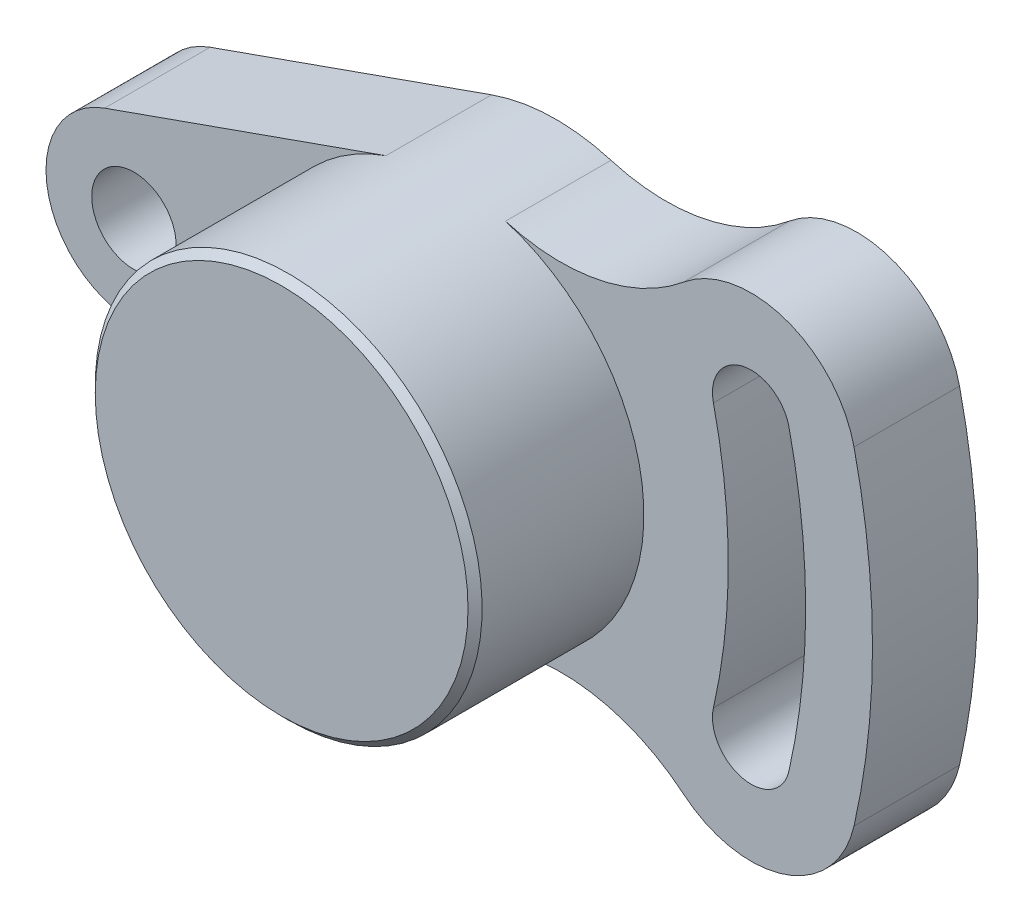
ISO-10303-21;
HEADER;
FILE_DESCRIPTION(('STEP AP214'),'2;1');
FILE_NAME('part.step','',(''),(''),'','','');
FILE_SCHEMA(('AUTOMOTIVE_DESIGN { 1 0 10303 214 1 1 1 1 }'));
ENDSEC;
DATA;
#1=APPLICATION_CONTEXT('core data for automotive mechanical design processes');
#2=APPLICATION_PROTOCOL_DEFINITION('international standard','automotive_design',2000,#1);
#3=PRODUCT_CONTEXT('',#1,'mechanical');
#4=PRODUCT('Part','Part','',(#3));
#5=PRODUCT_RELATED_PRODUCT_CATEGORY('part','',(#4));
#6=PRODUCT_DEFINITION_FORMATION('','',#4);
#7=PRODUCT_DEFINITION_CONTEXT('part definition',#1,'design');
#8=PRODUCT_DEFINITION('design','',#6,#7);
#9=PRODUCT_DEFINITION_SHAPE('','',#8);
#10=(LENGTH_UNIT() NAMED_UNIT(*) SI_UNIT(.MILLI.,.METRE.));
#11=(NAMED_UNIT(*) PLANE_ANGLE_UNIT() SI_UNIT($,.RADIAN.));
#12=(NAMED_UNIT(*) SI_UNIT($,.STERADIAN.) SOLID_ANGLE_UNIT());
#13=UNCERTAINTY_MEASURE_WITH_UNIT(LENGTH_MEASURE(1.E-05),#10,'distance_accuracy_value','');
#14=(GEOMETRIC_REPRESENTATION_CONTEXT(3) GLOBAL_UNCERTAINTY_ASSIGNED_CONTEXT((#13)) GLOBAL_UNIT_ASSIGNED_CONTEXT((#10,
#11,#12)) REPRESENTATION_CONTEXT('',''));
#15=CARTESIAN_POINT('',(0.,0.,0.));
#16=DIRECTION('',(0.,0.,1.));
#17=DIRECTION('',(1.,0.,0.));
#18=AXIS2_PLACEMENT_3D('',#15,#16,#17);
#19=CARTESIAN_POINT('',(87.7496438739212,-20.,15.));
#20=DIRECTION('',(0.,0.,1.));
#21=DIRECTION('',(0.,-1.,0.));
#22=AXIS2_PLACEMENT_3D('',#19,#20,#21);
#23=PLANE('',#22);
#24=CARTESIAN_POINT('',(45.,0.,15.));
#25=DIRECTION('',(0.,0.,1.));
#26=DIRECTION('',(0.,-1.,0.));
#27=AXIS2_PLACEMENT_3D('',#24,#25,#26);
#28=CIRCLE('',#27,27.5);
#29=CARTESIAN_POINT('',(52.8252184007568,-26.3631552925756,15.));
#30=VERTEX_POINT('',#29);
#31=CARTESIAN_POINT('',(52.8252184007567,26.3631552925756,15.));
#32=VERTEX_POINT('',#31);
#33=EDGE_CURVE('E130',#30,#32,#28,.T.);
#34=ORIENTED_EDGE('',*,*,#33,.F.);
#35=CARTESIAN_POINT('',(60.6438540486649,-52.7041332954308,15.));
#36=DIRECTION('',(0.,0.,1.));
#37=DIRECTION('',(0.,-1.,0.));
#38=AXIS2_PLACEMENT_3D('',#35,#36,#37);
#39=CIRCLE('',#38,27.4768663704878);
#40=CARTESIAN_POINT('',(78.1776843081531,-31.548921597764,15.));
#41=VERTEX_POINT('',#40);
#42=EDGE_CURVE('E114',#41,#30,#39,.T.);
#43=ORIENTED_EDGE('',*,*,#42,.F.);
#44=CARTESIAN_POINT('',(87.7496438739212,-20.,15.));
#45=DIRECTION('',(0.,0.,1.));
#46=DIRECTION('',(0.,-1.,0.));
#47=AXIS2_PLACEMENT_3D('',#44,#45,#46);
#48=CIRCLE('',#47,15.);
#49=CARTESIAN_POINT('',(102.374584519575,-23.3333333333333,15.));
#50=VERTEX_POINT('',#49);
#51=EDGE_CURVE('E287',#41,#50,#48,.T.);
#52=ORIENTED_EDGE('',*,*,#51,.T.);
#53=CARTESIAN_POINT('',(0.,0.,15.));
#54=DIRECTION('',(0.,0.,1.));
#55=DIRECTION('',(0.,-1.,0.));
#56=AXIS2_PLACEMENT_3D('',#53,#54,#55);
#57=CIRCLE('',#56,105.);
#58=CARTESIAN_POINT('',(102.374584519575,23.3333333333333,15.));
#59=VERTEX_POINT('',#58);
#60=EDGE_CURVE('E259',#50,#59,#57,.T.);
#61=ORIENTED_EDGE('',*,*,#60,.T.);
#62=CARTESIAN_POINT('',(87.7496438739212,20.,15.));
#63=DIRECTION('',(0.,0.,-1.));
#64=DIRECTION('',(0.,1.,0.));
#65=AXIS2_PLACEMENT_3D('',#62,#63,#64);
#66=CIRCLE('',#65,15.);
#67=CARTESIAN_POINT('',(78.1776843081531,31.548921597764,15.));
#68=VERTEX_POINT('',#67);
#69=EDGE_CURVE('E185',#68,#59,#66,.T.);
#70=ORIENTED_EDGE('',*,*,#69,.F.);
#71=CARTESIAN_POINT('',(60.6438540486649,52.7041332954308,15.));
#72=DIRECTION('',(0.,0.,-1.));
#73=DIRECTION('',(0.,1.,0.));
#74=AXIS2_PLACEMENT_3D('',#71,#72,#73);
#75=CIRCLE('',#74,27.4768663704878);
#76=EDGE_CURVE('E140',#68,#32,#75,.T.);
#77=ORIENTED_EDGE('',*,*,#76,.T.);
#78=EDGE_LOOP('',(#34,#43,#52,#61,#70,#77));
#79=FACE_BOUND('',#78,.T.);
#80=CARTESIAN_POINT('',(0.,0.,15.));
#81=DIRECTION('',(0.,0.,1.));
#82=DIRECTION('',(0.,-1.,0.));
#83=AXIS2_PLACEMENT_3D('',#80,#81,#82);
#84=CIRCLE('',#83,95.5);
#85=CARTESIAN_POINT('',(93.1121221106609,-21.2222222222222,15.));
#86=VERTEX_POINT('',#85);
#87=CARTESIAN_POINT('',(93.1121221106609,21.2222222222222,15.));
#88=VERTEX_POINT('',#87);
#89=EDGE_CURVE('E315',#86,#88,#84,.T.);
#90=ORIENTED_EDGE('',*,*,#89,.F.);
#91=CARTESIAN_POINT('',(87.7496438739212,-20.,15.));
#92=DIRECTION('',(0.,0.,1.));
#93=DIRECTION('',(0.,-1.,0.));
#94=AXIS2_PLACEMENT_3D('',#91,#92,#93);
#95=CIRCLE('',#94,5.5);
#96=CARTESIAN_POINT('',(82.3871656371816,-18.7777777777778,15.));
#97=VERTEX_POINT('',#96);
#98=EDGE_CURVE('E318',#97,#86,#95,.T.);
#99=ORIENTED_EDGE('',*,*,#98,.F.);
#100=CARTESIAN_POINT('',(0.,0.,15.));
#101=DIRECTION('',(0.,0.,1.));
#102=DIRECTION('',(0.,-1.,0.));
#103=AXIS2_PLACEMENT_3D('',#100,#101,#102);
#104=CIRCLE('',#103,84.5);
#105=CARTESIAN_POINT('',(82.3871656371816,18.7777777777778,15.));
#106=VERTEX_POINT('',#105);
#107=EDGE_CURVE('E311',#97,#106,#104,.T.);
#108=ORIENTED_EDGE('',*,*,#107,.T.);
#109=CARTESIAN_POINT('',(87.7496438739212,20.,15.));
#110=DIRECTION('',(0.,0.,-1.));
#111=DIRECTION('',(0.,1.,0.));
#112=AXIS2_PLACEMENT_3D('',#109,#110,#111);
#113=CIRCLE('',#112,5.5);
#114=EDGE_CURVE('E29',#106,#88,#113,.T.);
#115=ORIENTED_EDGE('',*,*,#114,.T.);
#116=EDGE_LOOP('',(#90,#99,#108,#115));
#117=FACE_BOUND('',#116,.T.);
#118=ADVANCED_FACE('F14',(#79,#117),#23,.T.);
#119=CARTESIAN_POINT('',(35.8333333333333,25.9272486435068,15.));
#120=VERTEX_POINT('',#119);
#121=CARTESIAN_POINT('',(35.8333333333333,-25.9272486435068,15.));
#122=VERTEX_POINT('',#121);
#123=EDGE_CURVE('E155',#120,#122,#28,.T.);
#124=ORIENTED_EDGE('',*,*,#123,.F.);
#125=DIRECTION('',(-0.942809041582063,-0.333333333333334,0.));
#126=VECTOR('',#125,1.);
#127=CARTESIAN_POINT('',(35.8333333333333,25.9272486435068,15.));
#128=LINE('',#127,#126);
#129=CARTESIAN_POINT('',(-4.1666666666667,11.7851130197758,15.));
#130=VERTEX_POINT('',#129);
#131=EDGE_CURVE('E175',#120,#130,#128,.T.);
#132=ORIENTED_EDGE('',*,*,#131,.T.);
#133=CARTESIAN_POINT('',(0.,0.,15.));
#134=DIRECTION('',(0.,0.,1.));
#135=DIRECTION('',(0.,-1.,0.));
#136=AXIS2_PLACEMENT_3D('',#133,#134,#135);
#137=CIRCLE('',#136,12.5);
#138=CARTESIAN_POINT('',(-4.1666666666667,-11.7851130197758,15.));
#139=VERTEX_POINT('',#138);
#140=EDGE_CURVE('E166',#130,#139,#137,.T.);
#141=ORIENTED_EDGE('',*,*,#140,.T.);
#142=DIRECTION('',(-0.942809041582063,0.333333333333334,0.));
#143=VECTOR('',#142,1.);
#144=CARTESIAN_POINT('',(35.8333333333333,-25.9272486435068,15.));
#145=LINE('',#144,#143);
#146=EDGE_CURVE('E125',#122,#139,#145,.T.);
#147=ORIENTED_EDGE('',*,*,#146,.F.);
#148=EDGE_LOOP('',(#124,#132,#141,#147));
#149=FACE_BOUND('',#148,.T.);
#150=CARTESIAN_POINT('',(0.,0.,15.));
#151=DIRECTION('',(0.,0.,1.));
#152=DIRECTION('',(0.,-1.,0.));
#153=AXIS2_PLACEMENT_3D('',#150,#151,#152);
#154=CIRCLE('',#153,6.);
#155=CARTESIAN_POINT('',(0.,-6.,15.));
#156=VERTEX_POINT('',#155);
#157=EDGE_CURVE('E144',#156,#156,#154,.T.);
#158=ORIENTED_EDGE('',*,*,#157,.F.);
#159=EDGE_LOOP('',(#158));
#160=FACE_BOUND('',#159,.T.);
#161=ADVANCED_FACE('F205',(#149,#160),#23,.T.);
#162=CARTESIAN_POINT('',(87.7496438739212,-20.,0.));
#163=DIRECTION('',(0.,0.,1.));
#164=DIRECTION('',(0.,-1.,0.));
#165=AXIS2_PLACEMENT_3D('',#162,#163,#164);
#166=PLANE('',#165);
#167=CARTESIAN_POINT('',(87.7496438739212,-20.,0.));
#168=DIRECTION('',(0.,0.,1.));
#169=DIRECTION('',(0.,-1.,0.));
#170=AXIS2_PLACEMENT_3D('',#167,#168,#169);
#171=CIRCLE('',#170,5.5);
#172=CARTESIAN_POINT('',(82.3871656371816,-18.7777777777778,0.));
#173=VERTEX_POINT('',#172);
#174=CARTESIAN_POINT('',(93.1121221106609,-21.2222222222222,0.));
#175=VERTEX_POINT('',#174);
#176=EDGE_CURVE('E37',#173,#175,#171,.T.);
#177=ORIENTED_EDGE('',*,*,#176,.T.);
#178=CARTESIAN_POINT('',(0.,0.,0.));
#179=DIRECTION('',(0.,0.,1.));
#180=DIRECTION('',(0.,-1.,0.));
#181=AXIS2_PLACEMENT_3D('',#178,#179,#180);
#182=CIRCLE('',#181,95.5);
#183=CARTESIAN_POINT('',(93.1121221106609,21.2222222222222,0.));
#184=VERTEX_POINT('',#183);
#185=EDGE_CURVE('E327',#175,#184,#182,.T.);
#186=ORIENTED_EDGE('',*,*,#185,.T.);
#187=CARTESIAN_POINT('',(87.7496438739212,20.,0.));
#188=DIRECTION('',(0.,0.,-1.));
#189=DIRECTION('',(0.,1.,0.));
#190=AXIS2_PLACEMENT_3D('',#187,#188,#189);
#191=CIRCLE('',#190,5.5);
#192=CARTESIAN_POINT('',(82.3871656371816,18.7777777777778,0.));
#193=VERTEX_POINT('',#192);
#194=EDGE_CURVE('E324',#193,#184,#191,.T.);
#195=ORIENTED_EDGE('',*,*,#194,.F.);
#196=CARTESIAN_POINT('',(0.,0.,0.));
#197=DIRECTION('',(0.,0.,1.));
#198=DIRECTION('',(0.,-1.,0.));
#199=AXIS2_PLACEMENT_3D('',#196,#197,#198);
#200=CIRCLE('',#199,84.5);
#201=EDGE_CURVE('E321',#173,#193,#200,.T.);
#202=ORIENTED_EDGE('',*,*,#201,.F.);
#203=EDGE_LOOP('',(#177,#186,#195,#202));
#204=FACE_BOUND('',#203,.T.);
#205=CARTESIAN_POINT('',(87.7496438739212,-20.,0.));
#206=DIRECTION('',(0.,0.,1.));
#207=DIRECTION('',(0.,-1.,0.));
#208=AXIS2_PLACEMENT_3D('',#205,#206,#207);
#209=CIRCLE('',#208,15.);
#210=CARTESIAN_POINT('',(78.1776843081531,-31.548921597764,0.));
#211=VERTEX_POINT('',#210);
#212=CARTESIAN_POINT('',(102.374584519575,-23.3333333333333,0.));
#213=VERTEX_POINT('',#212);
#214=EDGE_CURVE('E298',#211,#213,#209,.T.);
#215=ORIENTED_EDGE('',*,*,#214,.F.);
#216=CARTESIAN_POINT('',(60.6438540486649,-52.7041332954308,0.));
#217=DIRECTION('',(0.,0.,1.));
#218=DIRECTION('',(0.,-1.,0.));
#219=AXIS2_PLACEMENT_3D('',#216,#217,#218);
#220=CIRCLE('',#219,27.4768663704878);
#221=CARTESIAN_POINT('',(52.8252184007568,-26.3631552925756,0.));
#222=VERTEX_POINT('',#221);
#223=EDGE_CURVE('E285',#211,#222,#220,.T.);
#224=ORIENTED_EDGE('',*,*,#223,.T.);
#225=CARTESIAN_POINT('',(45.,0.,0.));
#226=DIRECTION('',(0.,0.,1.));
#227=DIRECTION('',(0.,-1.,0.));
#228=AXIS2_PLACEMENT_3D('',#225,#226,#227);
#229=CIRCLE('',#228,27.5);
#230=CARTESIAN_POINT('',(35.8333333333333,-25.9272486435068,0.));
#231=VERTEX_POINT('',#230);
#232=EDGE_CURVE('E132',#231,#222,#229,.T.);
#233=ORIENTED_EDGE('',*,*,#232,.F.);
#234=DIRECTION('',(-0.942809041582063,0.333333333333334,0.));
#235=VECTOR('',#234,1.);
#236=CARTESIAN_POINT('',(35.8333333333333,-25.9272486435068,0.));
#237=LINE('',#236,#235);
#238=CARTESIAN_POINT('',(-4.1666666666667,-11.7851130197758,0.));
#239=VERTEX_POINT('',#238);
#240=EDGE_CURVE('E279',#231,#239,#237,.T.);
#241=ORIENTED_EDGE('',*,*,#240,.T.);
#242=CARTESIAN_POINT('',(0.,0.,0.));
#243=DIRECTION('',(0.,0.,1.));
#244=DIRECTION('',(0.,-1.,0.));
#245=AXIS2_PLACEMENT_3D('',#242,#243,#244);
#246=CIRCLE('',#245,12.5);
#247=CARTESIAN_POINT('',(-4.1666666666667,11.7851130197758,0.));
#248=VERTEX_POINT('',#247);
#249=EDGE_CURVE('E277',#248,#239,#246,.T.);
#250=ORIENTED_EDGE('',*,*,#249,.F.);
#251=DIRECTION('',(-0.942809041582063,-0.333333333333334,0.));
#252=VECTOR('',#251,1.);
#253=CARTESIAN_POINT('',(35.8333333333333,25.9272486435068,0.));
#254=LINE('',#253,#252);
#255=CARTESIAN_POINT('',(35.8333333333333,25.9272486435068,0.));
#256=VERTEX_POINT('',#255);
#257=EDGE_CURVE('E269',#256,#248,#254,.T.);
#258=ORIENTED_EDGE('',*,*,#257,.F.);
#259=CARTESIAN_POINT('',(45.,0.,0.));
#260=DIRECTION('',(0.,0.,-1.));
#261=DIRECTION('',(0.,1.,0.));
#262=AXIS2_PLACEMENT_3D('',#259,#260,#261);
#263=CIRCLE('',#262,27.5);
#264=CARTESIAN_POINT('',(52.8252184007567,26.3631552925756,0.));
#265=VERTEX_POINT('',#264);
#266=EDGE_CURVE('E265',#256,#265,#263,.T.);
#267=ORIENTED_EDGE('',*,*,#266,.T.);
#268=CARTESIAN_POINT('',(60.6438540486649,52.7041332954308,0.));
#269=DIRECTION('',(0.,0.,-1.));
#270=DIRECTION('',(0.,1.,0.));
#271=AXIS2_PLACEMENT_3D('',#268,#269,#270);
#272=CIRCLE('',#271,27.4768663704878);
#273=CARTESIAN_POINT('',(78.1776843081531,31.548921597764,0.));
#274=VERTEX_POINT('',#273);
#275=EDGE_CURVE('E261',#274,#265,#272,.T.);
#276=ORIENTED_EDGE('',*,*,#275,.F.);
#277=CARTESIAN_POINT('',(87.7496438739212,20.,0.));
#278=DIRECTION('',(0.,0.,-1.));
#279=DIRECTION('',(0.,1.,0.));
#280=AXIS2_PLACEMENT_3D('',#277,#278,#279);
#281=CIRCLE('',#280,15.);
#282=CARTESIAN_POINT('',(102.374584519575,23.3333333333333,0.));
#283=VERTEX_POINT('',#282);
#284=EDGE_CURVE('E252',#274,#283,#281,.T.);
#285=ORIENTED_EDGE('',*,*,#284,.T.);
#286=CARTESIAN_POINT('',(0.,0.,0.));
#287=DIRECTION('',(0.,0.,1.));
#288=DIRECTION('',(0.,-1.,0.));
#289=AXIS2_PLACEMENT_3D('',#286,#287,#288);
#290=CIRCLE('',#289,105.);
#291=EDGE_CURVE('E297',#213,#283,#290,.T.);
#292=ORIENTED_EDGE('',*,*,#291,.F.);
#293=EDGE_LOOP('',(#215,#224,#233,#241,#250,#258,#267,#276,#285,#292));
#294=FACE_BOUND('',#293,.T.);
#295=CARTESIAN_POINT('',(0.,0.,0.));
#296=DIRECTION('',(0.,0.,1.));
#297=DIRECTION('',(0.,-1.,0.));
#298=AXIS2_PLACEMENT_3D('',#295,#296,#297);
#299=CIRCLE('',#298,6.);
#300=CARTESIAN_POINT('',(0.,-6.,0.));
#301=VERTEX_POINT('',#300);
#302=EDGE_CURVE('E141',#301,#301,#299,.T.);
#303=ORIENTED_EDGE('',*,*,#302,.T.);
#304=EDGE_LOOP('',(#303));
#305=FACE_BOUND('',#304,.T.);
#306=ADVANCED_FACE('F211',(#204,#294,#305),#166,.F.);
#307=CARTESIAN_POINT('',(87.7496438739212,-20.,15.));
#308=DIRECTION('',(0.,0.,-1.));
#309=DIRECTION('',(0.,1.,0.));
#310=AXIS2_PLACEMENT_3D('',#307,#308,#309);
#311=CYLINDRICAL_SURFACE('',#310,15.);
#312=DIRECTION('',(0.,0.,-1.));
#313=VECTOR('',#312,1.);
#314=CARTESIAN_POINT('',(102.374584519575,-23.3333333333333,15.));
#315=LINE('',#314,#313);
#316=EDGE_CURVE('E150',#50,#213,#315,.T.);
#317=ORIENTED_EDGE('',*,*,#316,.F.);
#318=ORIENTED_EDGE('',*,*,#51,.F.);
#319=DIRECTION('',(0.,0.,-1.));
#320=VECTOR('',#319,1.);
#321=CARTESIAN_POINT('',(78.1776843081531,-31.548921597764,15.));
#322=LINE('',#321,#320);
#323=EDGE_CURVE('E120',#41,#211,#322,.T.);
#324=ORIENTED_EDGE('',*,*,#323,.T.);
#325=ORIENTED_EDGE('',*,*,#214,.T.);
#326=EDGE_LOOP('',(#317,#318,#324,#325));
#327=FACE_BOUND('',#326,.T.);
#328=ADVANCED_FACE('F216',(#327),#311,.T.);
#329=CARTESIAN_POINT('',(0.,0.,15.));
#330=DIRECTION('',(0.,0.,-1.));
#331=DIRECTION('',(0.,1.,0.));
#332=AXIS2_PLACEMENT_3D('',#329,#330,#331);
#333=CYLINDRICAL_SURFACE('',#332,105.);
#334=DIRECTION('',(0.,0.,-1.));
#335=VECTOR('',#334,1.);
#336=CARTESIAN_POINT('',(102.374584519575,23.3333333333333,15.));
#337=LINE('',#336,#335);
#338=EDGE_CURVE('E255',#59,#283,#337,.T.);
#339=ORIENTED_EDGE('',*,*,#338,.F.);
#340=ORIENTED_EDGE('',*,*,#60,.F.);
#341=ORIENTED_EDGE('',*,*,#316,.T.);
#342=ORIENTED_EDGE('',*,*,#291,.T.);
#343=EDGE_LOOP('',(#339,#340,#341,#342));
#344=FACE_BOUND('',#343,.T.);
#345=ADVANCED_FACE('F16',(#344),#333,.T.);
#346=CARTESIAN_POINT('',(87.7496438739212,20.,15.));
#347=DIRECTION('',(0.,0.,-1.));
#348=DIRECTION('',(0.,1.,0.));
#349=AXIS2_PLACEMENT_3D('',#346,#347,#348);
#350=CYLINDRICAL_SURFACE('',#349,15.);
#351=DIRECTION('',(0.,0.,-1.));
#352=VECTOR('',#351,1.);
#353=CARTESIAN_POINT('',(78.1776843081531,31.548921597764,15.));
#354=LINE('',#353,#352);
#355=EDGE_CURVE('E181',#68,#274,#354,.T.);
#356=ORIENTED_EDGE('',*,*,#355,.F.);
#357=ORIENTED_EDGE('',*,*,#69,.T.);
#358=ORIENTED_EDGE('',*,*,#338,.T.);
#359=ORIENTED_EDGE('',*,*,#284,.F.);
#360=EDGE_LOOP('',(#356,#357,#358,#359));
#361=FACE_BOUND('',#360,.T.);
#362=ADVANCED_FACE('F240',(#361),#350,.T.);
#363=CARTESIAN_POINT('',(60.6438540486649,52.7041332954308,15.));
#364=DIRECTION('',(0.,0.,-1.));
#365=DIRECTION('',(0.,1.,0.));
#366=AXIS2_PLACEMENT_3D('',#363,#364,#365);
#367=CYLINDRICAL_SURFACE('',#366,27.4768663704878);
#368=DIRECTION('',(0.,0.,-1.));
#369=VECTOR('',#368,1.);
#370=CARTESIAN_POINT('',(52.8252184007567,26.3631552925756,15.));
#371=LINE('',#370,#369);
#372=EDGE_CURVE('E171',#32,#265,#371,.T.);
#373=ORIENTED_EDGE('',*,*,#372,.F.);
#374=ORIENTED_EDGE('',*,*,#76,.F.);
#375=ORIENTED_EDGE('',*,*,#355,.T.);
#376=ORIENTED_EDGE('',*,*,#275,.T.);
#377=EDGE_LOOP('',(#373,#374,#375,#376));
#378=FACE_BOUND('',#377,.T.);
#379=ADVANCED_FACE('F237',(#378),#367,.F.);
#380=CARTESIAN_POINT('',(35.8333333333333,25.9272486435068,15.));
#381=DIRECTION('',(0.333333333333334,-0.942809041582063,0.));
#382=DIRECTION('',(0.942809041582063,0.333333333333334,0.));
#383=AXIS2_PLACEMENT_3D('',#380,#381,#382);
#384=PLANE('',#383);
#385=DIRECTION('',(0.,0.,-1.));
#386=VECTOR('',#385,1.);
#387=CARTESIAN_POINT('',(-4.1666666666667,11.7851130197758,15.));
#388=LINE('',#387,#386);
#389=EDGE_CURVE('E172',#130,#248,#388,.T.);
#390=ORIENTED_EDGE('',*,*,#389,.F.);
#391=ORIENTED_EDGE('',*,*,#131,.F.);
#392=DIRECTION('',(0.,0.,-1.));
#393=VECTOR('',#392,1.);
#394=CARTESIAN_POINT('',(35.8333333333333,25.9272486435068,15.));
#395=LINE('',#394,#393);
#396=EDGE_CURVE('E169',#120,#256,#395,.T.);
#397=ORIENTED_EDGE('',*,*,#396,.T.);
#398=ORIENTED_EDGE('',*,*,#257,.T.);
#399=EDGE_LOOP('',(#390,#391,#397,#398));
#400=FACE_BOUND('',#399,.T.);
#401=ADVANCED_FACE('F233',(#400),#384,.F.);
#402=CARTESIAN_POINT('',(0.,0.,15.));
#403=DIRECTION('',(0.,0.,-1.));
#404=DIRECTION('',(0.,1.,0.));
#405=AXIS2_PLACEMENT_3D('',#402,#403,#404);
#406=CYLINDRICAL_SURFACE('',#405,12.5);
#407=DIRECTION('',(0.,0.,-1.));
#408=VECTOR('',#407,1.);
#409=CARTESIAN_POINT('',(-4.1666666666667,-11.7851130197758,15.));
#410=LINE('',#409,#408);
#411=EDGE_CURVE('E161',#139,#239,#410,.T.);
#412=ORIENTED_EDGE('',*,*,#411,.F.);
#413=ORIENTED_EDGE('',*,*,#140,.F.);
#414=ORIENTED_EDGE('',*,*,#389,.T.);
#415=ORIENTED_EDGE('',*,*,#249,.T.);
#416=EDGE_LOOP('',(#412,#413,#414,#415));
#417=FACE_BOUND('',#416,.T.);
#418=ADVANCED_FACE('F229',(#417),#406,.T.);
#419=CARTESIAN_POINT('',(35.8333333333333,-25.9272486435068,15.));
#420=DIRECTION('',(-0.333333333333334,-0.942809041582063,0.));
#421=DIRECTION('',(0.942809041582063,-0.333333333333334,0.));
#422=AXIS2_PLACEMENT_3D('',#419,#420,#421);
#423=PLANE('',#422);
#424=DIRECTION('',(0.,0.,-1.));
#425=VECTOR('',#424,1.);
#426=CARTESIAN_POINT('',(35.8333333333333,-25.9272486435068,15.));
#427=LINE('',#426,#425);
#428=EDGE_CURVE('E134',#122,#231,#427,.T.);
#429=ORIENTED_EDGE('',*,*,#428,.F.);
#430=ORIENTED_EDGE('',*,*,#146,.T.);
#431=ORIENTED_EDGE('',*,*,#411,.T.);
#432=ORIENTED_EDGE('',*,*,#240,.F.);
#433=EDGE_LOOP('',(#429,#430,#431,#432));
#434=FACE_BOUND('',#433,.T.);
#435=ADVANCED_FACE('F225',(#434),#423,.T.);
#436=CARTESIAN_POINT('',(45.,0.,15.));
#437=DIRECTION('',(0.,0.,-1.));
#438=DIRECTION('',(0.,1.,0.));
#439=AXIS2_PLACEMENT_3D('',#436,#437,#438);
#440=CYLINDRICAL_SURFACE('',#439,27.5);
#441=CARTESIAN_POINT('',(45.,0.,38.));
#442=DIRECTION('',(0.,0.,1.));
#443=DIRECTION('',(0.,-1.,0.));
#444=AXIS2_PLACEMENT_3D('',#441,#442,#443);
#445=CIRCLE('',#444,27.5);
#446=CARTESIAN_POINT('',(45.,-27.5,38.));
#447=VERTEX_POINT('',#446);
#448=EDGE_CURVE('E9',#447,#447,#445,.F.);
#449=ORIENTED_EDGE('',*,*,#448,.T.);
#450=EDGE_LOOP('',(#449));
#451=FACE_BOUND('',#450,.T.);
#452=DIRECTION('',(0.,0.,-1.));
#453=VECTOR('',#452,1.);
#454=CARTESIAN_POINT('',(52.8252184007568,-26.3631552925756,15.));
#455=LINE('',#454,#453);
#456=EDGE_CURVE('E118',#30,#222,#455,.T.);
#457=ORIENTED_EDGE('',*,*,#456,.F.);
#458=ORIENTED_EDGE('',*,*,#33,.T.);
#459=ORIENTED_EDGE('',*,*,#372,.T.);
#460=ORIENTED_EDGE('',*,*,#266,.F.);
#461=ORIENTED_EDGE('',*,*,#396,.F.);
#462=ORIENTED_EDGE('',*,*,#123,.T.);
#463=ORIENTED_EDGE('',*,*,#428,.T.);
#464=ORIENTED_EDGE('',*,*,#232,.T.);
#465=EDGE_LOOP('',(#457,#458,#459,#460,#461,#462,#463,#464));
#466=FACE_BOUND('',#465,.T.);
#467=ADVANCED_FACE('F129',(#451,#466),#440,.T.);
#468=CARTESIAN_POINT('',(60.6438540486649,-52.7041332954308,15.));
#469=DIRECTION('',(0.,0.,-1.));
#470=DIRECTION('',(0.,1.,0.));
#471=AXIS2_PLACEMENT_3D('',#468,#469,#470);
#472=CYLINDRICAL_SURFACE('',#471,27.4768663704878);
#473=ORIENTED_EDGE('',*,*,#42,.T.);
#474=ORIENTED_EDGE('',*,*,#456,.T.);
#475=ORIENTED_EDGE('',*,*,#223,.F.);
#476=ORIENTED_EDGE('',*,*,#323,.F.);
#477=EDGE_LOOP('',(#473,#474,#475,#476));
#478=FACE_BOUND('',#477,.T.);
#479=ADVANCED_FACE('F116',(#478),#472,.F.);
#480=CARTESIAN_POINT('',(87.7496438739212,-20.,15.));
#481=DIRECTION('',(0.,0.,-1.));
#482=DIRECTION('',(0.,1.,0.));
#483=AXIS2_PLACEMENT_3D('',#480,#481,#482);
#484=CYLINDRICAL_SURFACE('',#483,5.5);
#485=DIRECTION('',(0.,0.,-1.));
#486=VECTOR('',#485,1.);
#487=CARTESIAN_POINT('',(93.1121221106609,-21.2222222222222,15.));
#488=LINE('',#487,#486);
#489=EDGE_CURVE('E299',#86,#175,#488,.T.);
#490=ORIENTED_EDGE('',*,*,#489,.T.);
#491=ORIENTED_EDGE('',*,*,#176,.F.);
#492=DIRECTION('',(0.,0.,-1.));
#493=VECTOR('',#492,1.);
#494=CARTESIAN_POINT('',(82.3871656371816,-18.7777777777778,15.));
#495=LINE('',#494,#493);
#496=EDGE_CURVE('E309',#97,#173,#495,.T.);
#497=ORIENTED_EDGE('',*,*,#496,.F.);
#498=ORIENTED_EDGE('',*,*,#98,.T.);
#499=EDGE_LOOP('',(#490,#491,#497,#498));
#500=FACE_BOUND('',#499,.T.);
#501=ADVANCED_FACE('F222',(#500),#484,.F.);
#502=CARTESIAN_POINT('',(0.,0.,15.));
#503=DIRECTION('',(0.,0.,-1.));
#504=DIRECTION('',(0.,1.,0.));
#505=AXIS2_PLACEMENT_3D('',#502,#503,#504);
#506=CYLINDRICAL_SURFACE('',#505,95.5);
#507=DIRECTION('',(0.,0.,-1.));
#508=VECTOR('',#507,1.);
#509=CARTESIAN_POINT('',(93.1121221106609,21.2222222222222,15.));
#510=LINE('',#509,#508);
#511=EDGE_CURVE('E305',#88,#184,#510,.T.);
#512=ORIENTED_EDGE('',*,*,#511,.T.);
#513=ORIENTED_EDGE('',*,*,#185,.F.);
#514=ORIENTED_EDGE('',*,*,#489,.F.);
#515=ORIENTED_EDGE('',*,*,#89,.T.);
#516=EDGE_LOOP('',(#512,#513,#514,#515));
#517=FACE_BOUND('',#516,.T.);
#518=ADVANCED_FACE('F352',(#517),#506,.F.);
#519=CARTESIAN_POINT('',(87.7496438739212,20.,15.));
#520=DIRECTION('',(0.,0.,-1.));
#521=DIRECTION('',(0.,1.,0.));
#522=AXIS2_PLACEMENT_3D('',#519,#520,#521);
#523=CYLINDRICAL_SURFACE('',#522,5.5);
#524=DIRECTION('',(0.,0.,-1.));
#525=VECTOR('',#524,1.);
#526=CARTESIAN_POINT('',(82.3871656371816,18.7777777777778,15.));
#527=LINE('',#526,#525);
#528=EDGE_CURVE('E307',#106,#193,#527,.T.);
#529=ORIENTED_EDGE('',*,*,#528,.T.);
#530=ORIENTED_EDGE('',*,*,#194,.T.);
#531=ORIENTED_EDGE('',*,*,#511,.F.);
#532=ORIENTED_EDGE('',*,*,#114,.F.);
#533=EDGE_LOOP('',(#529,#530,#531,#532));
#534=FACE_BOUND('',#533,.T.);
#535=ADVANCED_FACE('F353',(#534),#523,.F.);
#536=CARTESIAN_POINT('',(0.,0.,15.));
#537=DIRECTION('',(0.,0.,-1.));
#538=DIRECTION('',(0.,1.,0.));
#539=AXIS2_PLACEMENT_3D('',#536,#537,#538);
#540=CYLINDRICAL_SURFACE('',#539,84.5);
#541=ORIENTED_EDGE('',*,*,#107,.F.);
#542=ORIENTED_EDGE('',*,*,#496,.T.);
#543=ORIENTED_EDGE('',*,*,#201,.T.);
#544=ORIENTED_EDGE('',*,*,#528,.F.);
#545=EDGE_LOOP('',(#541,#542,#543,#544));
#546=FACE_BOUND('',#545,.T.);
#547=ADVANCED_FACE('F336',(#546),#540,.T.);
#548=CARTESIAN_POINT('',(0.,0.,15.));
#549=DIRECTION('',(0.,0.,-1.));
#550=DIRECTION('',(0.,1.,0.));
#551=AXIS2_PLACEMENT_3D('',#548,#549,#550);
#552=CYLINDRICAL_SURFACE('',#551,6.);
#553=ORIENTED_EDGE('',*,*,#157,.T.);
#554=EDGE_LOOP('',(#553));
#555=FACE_BOUND('',#554,.T.);
#556=ORIENTED_EDGE('',*,*,#302,.F.);
#557=EDGE_LOOP('',(#556));
#558=FACE_BOUND('',#557,.T.);
#559=ADVANCED_FACE('F201',(#555,#558),#552,.F.);
#560=CARTESIAN_POINT('',(45.,0.,39.));
#561=DIRECTION('',(0.,0.,1.));
#562=DIRECTION('',(0.,-1.,0.));
#563=AXIS2_PLACEMENT_3D('',#560,#561,#562);
#564=PLANE('',#563);
#565=CARTESIAN_POINT('',(45.,0.,39.));
#566=DIRECTION('',(0.,0.,1.));
#567=DIRECTION('',(0.,-1.,0.));
#568=AXIS2_PLACEMENT_3D('',#565,#566,#567);
#569=CIRCLE('',#568,26.5);
#570=CARTESIAN_POINT('',(45.,-26.5,39.));
#571=VERTEX_POINT('',#570);
#572=EDGE_CURVE('E22',#571,#571,#569,.T.);
#573=ORIENTED_EDGE('',*,*,#572,.T.);
#574=EDGE_LOOP('',(#573));
#575=FACE_BOUND('',#574,.T.);
#576=ADVANCED_FACE('F190',(#575),#564,.T.);
#577=CARTESIAN_POINT('',(45.,0.,39.));
#578=DIRECTION('',(0.,0.,-1.));
#579=DIRECTION('',(0.,1.,0.));
#580=AXIS2_PLACEMENT_3D('',#577,#578,#579);
#581=CONICAL_SURFACE('',#580,26.5,0.785398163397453);
#582=ORIENTED_EDGE('',*,*,#448,.F.);
#583=EDGE_LOOP('',(#582));
#584=FACE_BOUND('',#583,.T.);
#585=ORIENTED_EDGE('',*,*,#572,.F.);
#586=EDGE_LOOP('',(#585));
#587=FACE_BOUND('',#586,.T.);
#588=ADVANCED_FACE('F192',(#584,#587),#581,.T.);
#589=CLOSED_SHELL('',(#118,#161,#306,#328,#345,#362,#379,#401,#418,#435,#467,#479,#501,#518,
#535,#547,#559,#576,#588));
#590=MANIFOLD_SOLID_BREP('B1',#589);
#591=ADVANCED_BREP_SHAPE_REPRESENTATION('',(#18,#590),#14);
#592=SHAPE_DEFINITION_REPRESENTATION(#9,#591);
ENDSEC;
END-ISO-10303-21;
